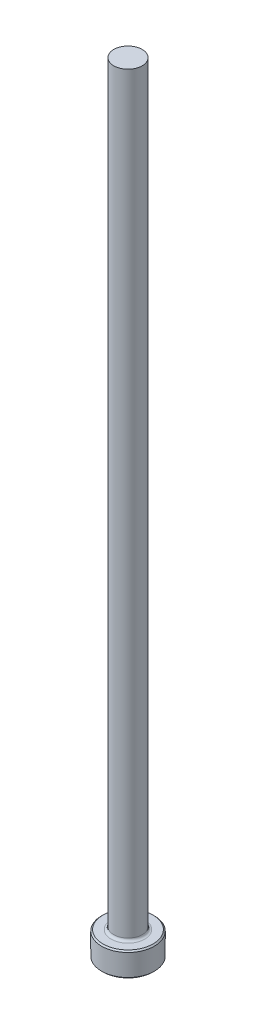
from build123d import *

# Parameters (mm, degrees)
CHAMFER1_SIZE = 0.254
FILLET1_R     = 0.508


with BuildPart() as part:
    # Sketch1 → Revolve1 (revolve)
    with BuildSketch(Plane.XY, mode=Mode.PRIVATE) as revolve1_sk:
        Polygon((0, 0), (-5.1562, 0), (-5.1562, 4.7498), (-2.77749, 4.7498), (-2.77749, 152.4), (0, 152.4), align=None)
    revolve(revolve1_sk.sketch.rotate(Axis((0, 259.958771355, 0), (0, -1, 0)), 270), axis=Axis((0, 259.958771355, 0), (0, -1, 0)))

    # Chamfer1
    chamfer1_edges = [part.edges().sort_by_distance(p)[0] for p in [
        (0, 4.7498, -5.1562),
        (0, 0, -5.1562),
    ]]
    chamfer(chamfer1_edges, length=CHAMFER1_SIZE)

    # Fillet1
    fillet1_edges = [part.edges().sort_by_distance(p)[0] for p in [
        (0, 4.7498, -2.77749),
    ]]
    fillet(fillet1_edges, radius=FILLET1_R)


solid = part.part
